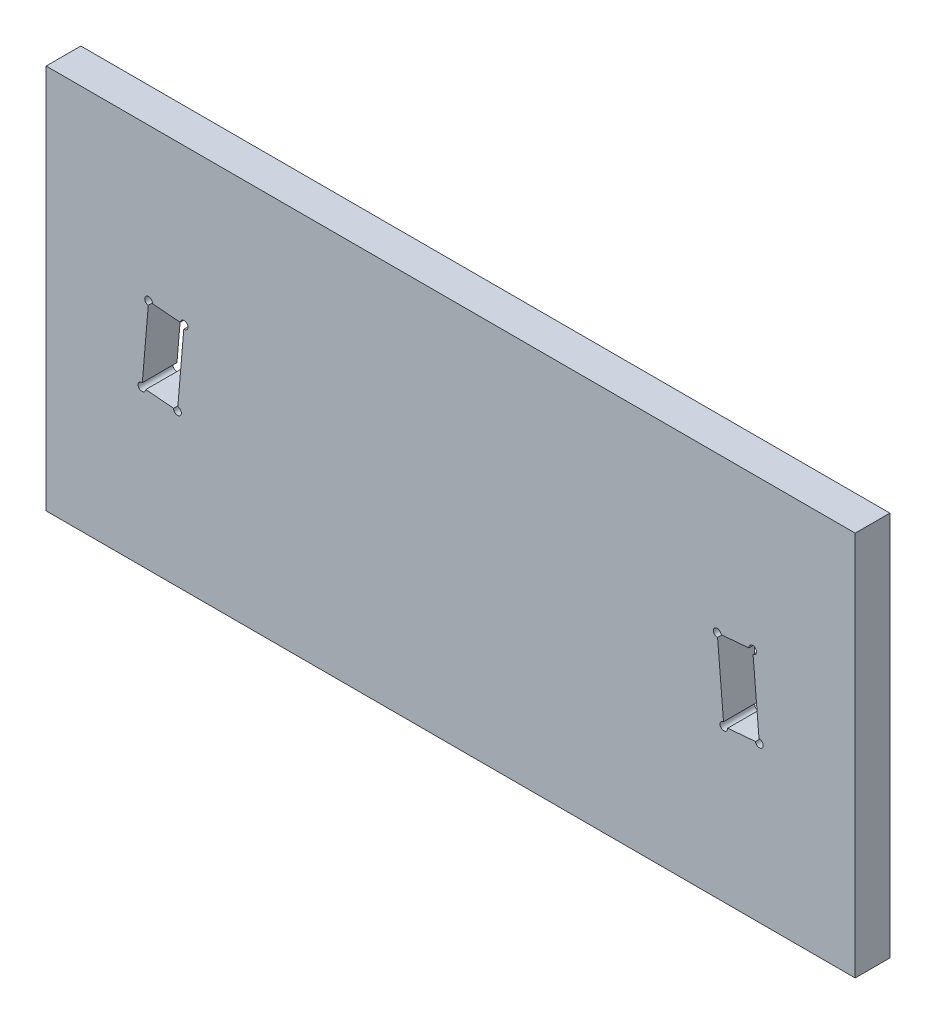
ISO-10303-21;
HEADER;
FILE_DESCRIPTION(('STEP AP214'),'2;1');
FILE_NAME('part.step','',(''),(''),'','','');
FILE_SCHEMA(('AUTOMOTIVE_DESIGN { 1 0 10303 214 1 1 1 1 }'));
ENDSEC;
DATA;
#1=APPLICATION_CONTEXT('core data for automotive mechanical design processes');
#2=APPLICATION_PROTOCOL_DEFINITION('international standard','automotive_design',2000,#1);
#3=PRODUCT_CONTEXT('',#1,'mechanical');
#4=PRODUCT('Part','Part','',(#3));
#5=PRODUCT_RELATED_PRODUCT_CATEGORY('part','',(#4));
#6=PRODUCT_DEFINITION_FORMATION('','',#4);
#7=PRODUCT_DEFINITION_CONTEXT('part definition',#1,'design');
#8=PRODUCT_DEFINITION('design','',#6,#7);
#9=PRODUCT_DEFINITION_SHAPE('','',#8);
#10=(LENGTH_UNIT() NAMED_UNIT(*) SI_UNIT(.MILLI.,.METRE.));
#11=(NAMED_UNIT(*) PLANE_ANGLE_UNIT() SI_UNIT($,.RADIAN.));
#12=(NAMED_UNIT(*) SI_UNIT($,.STERADIAN.) SOLID_ANGLE_UNIT());
#13=UNCERTAINTY_MEASURE_WITH_UNIT(LENGTH_MEASURE(1.E-05),#10,'distance_accuracy_value','');
#14=(GEOMETRIC_REPRESENTATION_CONTEXT(3) GLOBAL_UNCERTAINTY_ASSIGNED_CONTEXT((#13)) GLOBAL_UNIT_ASSIGNED_CONTEXT((#10,
#11,#12)) REPRESENTATION_CONTEXT('',''));
#15=CARTESIAN_POINT('',(0.,0.,0.));
#16=DIRECTION('',(0.,0.,1.));
#17=DIRECTION('',(1.,0.,0.));
#18=AXIS2_PLACEMENT_3D('',#15,#16,#17);
#19=CARTESIAN_POINT('',(0.,0.,18.));
#20=DIRECTION('',(0.,0.,-1.));
#21=DIRECTION('',(-1.,0.,0.));
#22=AXIS2_PLACEMENT_3D('',#19,#20,#21);
#23=PLANE('',#22);
#24=DIRECTION('',(0.0848221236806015,-0.996396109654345,0.));
#25=VECTOR('',#24,1.);
#26=CARTESIAN_POINT('',(123.236552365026,394.31803128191,18.));
#27=LINE('',#26,#25);
#28=CARTESIAN_POINT('',(119.970900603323,432.679281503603,18.));
#29=VERTEX_POINT('',#28);
#30=CARTESIAN_POINT('',(123.066908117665,396.310823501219,18.));
#31=VERTEX_POINT('',#30);
#32=EDGE_CURVE('E212',#29,#31,#27,.T.);
#33=ORIENTED_EDGE('',*,*,#32,.F.);
#34=CARTESIAN_POINT('',(119.801256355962,434.672073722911,18.));
#35=DIRECTION('',(0.,0.,1.));
#36=DIRECTION('',(1.,0.,0.));
#37=AXIS2_PLACEMENT_3D('',#34,#35,#36);
#38=CIRCLE('',#37,2.);
#39=CARTESIAN_POINT('',(121.79404857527,434.841717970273,18.));
#40=VERTEX_POINT('',#39);
#41=EDGE_CURVE('E175',#40,#29,#38,.T.);
#42=ORIENTED_EDGE('',*,*,#41,.F.);
#43=DIRECTION('',(-0.996396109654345,-0.0848221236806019,0.));
#44=VECTOR('',#43,1.);
#45=CARTESIAN_POINT('',(119.801256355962,434.672073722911,18.));
#46=LINE('',#45,#44);
#47=CARTESIAN_POINT('',(136.241792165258,436.071638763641,18.));
#48=VERTEX_POINT('',#47);
#49=EDGE_CURVE('E207',#48,#40,#46,.T.);
#50=ORIENTED_EDGE('',*,*,#49,.F.);
#51=CARTESIAN_POINT('',(138.234584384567,436.241283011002,18.));
#52=DIRECTION('',(0.,0.,1.));
#53=DIRECTION('',(1.,0.,0.));
#54=AXIS2_PLACEMENT_3D('',#51,#52,#53);
#55=CIRCLE('',#54,2.);
#56=CARTESIAN_POINT('',(138.404228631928,434.248490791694,18.));
#57=VERTEX_POINT('',#56);
#58=EDGE_CURVE('E509',#57,#48,#55,.T.);
#59=ORIENTED_EDGE('',*,*,#58,.F.);
#60=DIRECTION('',(-0.0848221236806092,0.996396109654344,0.));
#61=VECTOR('',#60,1.);
#62=CARTESIAN_POINT('',(138.234584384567,436.241283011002,18.));
#63=LINE('',#62,#61);
#64=CARTESIAN_POINT('',(141.50023614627,397.88003278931,18.));
#65=VERTEX_POINT('',#64);
#66=EDGE_CURVE('E501',#65,#57,#63,.T.);
#67=ORIENTED_EDGE('',*,*,#66,.F.);
#68=CARTESIAN_POINT('',(141.669880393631,395.887240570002,18.));
#69=DIRECTION('',(0.,0.,1.));
#70=DIRECTION('',(1.,0.,0.));
#71=AXIS2_PLACEMENT_3D('',#68,#69,#70);
#72=CIRCLE('',#71,2.);
#73=CARTESIAN_POINT('',(139.677088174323,395.71759632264,18.));
#74=VERTEX_POINT('',#73);
#75=EDGE_CURVE('E56',#74,#65,#72,.T.);
#76=ORIENTED_EDGE('',*,*,#75,.F.);
#77=DIRECTION('',(0.996396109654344,0.0848221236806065,0.));
#78=VECTOR('',#77,1.);
#79=CARTESIAN_POINT('',(141.669880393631,395.887240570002,18.));
#80=LINE('',#79,#78);
#81=CARTESIAN_POINT('',(125.229344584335,394.487675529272,18.));
#82=VERTEX_POINT('',#81);
#83=EDGE_CURVE('E499',#82,#74,#80,.T.);
#84=ORIENTED_EDGE('',*,*,#83,.F.);
#85=CARTESIAN_POINT('',(123.236552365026,394.31803128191,18.));
#86=DIRECTION('',(0.,0.,1.));
#87=DIRECTION('',(1.,0.,0.));
#88=AXIS2_PLACEMENT_3D('',#85,#86,#87);
#89=CIRCLE('',#88,2.);
#90=EDGE_CURVE('E48',#31,#82,#89,.T.);
#91=ORIENTED_EDGE('',*,*,#90,.F.);
#92=EDGE_LOOP('',(#33,#42,#50,#59,#67,#76,#84,#91));
#93=FACE_BOUND('',#92,.T.);
#94=DIRECTION('',(0.,1.,0.));
#95=VECTOR('',#94,1.);
#96=CARTESIAN_POINT('',(191.423400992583,515.279657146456,18.));
#97=LINE('',#96,#95);
#98=CARTESIAN_POINT('',(191.423400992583,315.279657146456,18.));
#99=VERTEX_POINT('',#98);
#100=CARTESIAN_POINT('',(191.423400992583,515.279657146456,18.));
#101=VERTEX_POINT('',#100);
#102=EDGE_CURVE('E213',#99,#101,#97,.T.);
#103=ORIENTED_EDGE('',*,*,#102,.T.);
#104=DIRECTION('',(-1.,0.,0.));
#105=VECTOR('',#104,1.);
#106=CARTESIAN_POINT('',(-228.576599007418,515.279657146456,18.));
#107=LINE('',#106,#105);
#108=CARTESIAN_POINT('',(-228.576599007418,515.279657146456,18.));
#109=VERTEX_POINT('',#108);
#110=EDGE_CURVE('E216',#101,#109,#107,.T.);
#111=ORIENTED_EDGE('',*,*,#110,.T.);
#112=DIRECTION('',(0.,-1.,0.));
#113=VECTOR('',#112,1.);
#114=CARTESIAN_POINT('',(-228.576599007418,515.279657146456,18.));
#115=LINE('',#114,#113);
#116=CARTESIAN_POINT('',(-228.576599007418,315.279657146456,18.));
#117=VERTEX_POINT('',#116);
#118=EDGE_CURVE('E219',#109,#117,#115,.T.);
#119=ORIENTED_EDGE('',*,*,#118,.T.);
#120=DIRECTION('',(1.,0.,0.));
#121=VECTOR('',#120,1.);
#122=CARTESIAN_POINT('',(191.423400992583,315.279657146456,18.));
#123=LINE('',#122,#121);
#124=EDGE_CURVE('E221',#117,#99,#123,.T.);
#125=ORIENTED_EDGE('',*,*,#124,.T.);
#126=EDGE_LOOP('',(#103,#111,#119,#125));
#127=FACE_BOUND('',#126,.T.);
#128=DIRECTION('',(-0.996396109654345,0.0848221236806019,0.));
#129=VECTOR('',#128,1.);
#130=CARTESIAN_POINT('',(-156.954454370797,434.672073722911,18.));
#131=LINE('',#130,#129);
#132=CARTESIAN_POINT('',(-158.947246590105,434.841717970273,18.));
#133=VERTEX_POINT('',#132);
#134=CARTESIAN_POINT('',(-173.394990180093,436.071638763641,18.));
#135=VERTEX_POINT('',#134);
#136=EDGE_CURVE('E204',#133,#135,#131,.T.);
#137=ORIENTED_EDGE('',*,*,#136,.F.);
#138=CARTESIAN_POINT('',(-156.954454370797,434.672073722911,18.));
#139=DIRECTION('',(0.,0.,1.));
#140=DIRECTION('',(1.,0.,0.));
#141=AXIS2_PLACEMENT_3D('',#138,#139,#140);
#142=CIRCLE('',#141,2.);
#143=CARTESIAN_POINT('',(-157.124098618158,432.679281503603,18.));
#144=VERTEX_POINT('',#143);
#145=EDGE_CURVE('E460',#144,#133,#142,.T.);
#146=ORIENTED_EDGE('',*,*,#145,.F.);
#147=DIRECTION('',(0.0848221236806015,0.996396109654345,0.));
#148=VECTOR('',#147,1.);
#149=CARTESIAN_POINT('',(-160.389750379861,394.31803128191,18.));
#150=LINE('',#149,#148);
#151=CARTESIAN_POINT('',(-160.2201061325,396.310823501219,18.));
#152=VERTEX_POINT('',#151);
#153=EDGE_CURVE('E481',#152,#144,#150,.T.);
#154=ORIENTED_EDGE('',*,*,#153,.F.);
#155=CARTESIAN_POINT('',(-160.389750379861,394.31803128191,18.));
#156=DIRECTION('',(0.,0.,1.));
#157=DIRECTION('',(1.,0.,0.));
#158=AXIS2_PLACEMENT_3D('',#155,#156,#157);
#159=CIRCLE('',#158,2.);
#160=CARTESIAN_POINT('',(-162.38254259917,394.487675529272,18.));
#161=VERTEX_POINT('',#160);
#162=EDGE_CURVE('E536',#161,#152,#159,.T.);
#163=ORIENTED_EDGE('',*,*,#162,.F.);
#164=DIRECTION('',(0.996396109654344,-0.0848221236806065,0.));
#165=VECTOR('',#164,1.);
#166=CARTESIAN_POINT('',(-178.823078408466,395.887240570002,18.));
#167=LINE('',#166,#165);
#168=CARTESIAN_POINT('',(-176.830286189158,395.71759632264,18.));
#169=VERTEX_POINT('',#168);
#170=EDGE_CURVE('E483',#169,#161,#167,.T.);
#171=ORIENTED_EDGE('',*,*,#170,.F.);
#172=CARTESIAN_POINT('',(-178.823078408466,395.887240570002,18.));
#173=DIRECTION('',(0.,0.,1.));
#174=DIRECTION('',(1.,0.,0.));
#175=AXIS2_PLACEMENT_3D('',#172,#173,#174);
#176=CIRCLE('',#175,2.);
#177=CARTESIAN_POINT('',(-178.653434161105,397.88003278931,18.));
#178=VERTEX_POINT('',#177);
#179=EDGE_CURVE('E555',#178,#169,#176,.T.);
#180=ORIENTED_EDGE('',*,*,#179,.F.);
#181=DIRECTION('',(-0.0848221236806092,-0.996396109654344,0.));
#182=VECTOR('',#181,1.);
#183=CARTESIAN_POINT('',(-175.387782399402,436.241283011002,18.));
#184=LINE('',#183,#182);
#185=CARTESIAN_POINT('',(-175.557426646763,434.248490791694,18.));
#186=VERTEX_POINT('',#185);
#187=EDGE_CURVE('E198',#186,#178,#184,.T.);
#188=ORIENTED_EDGE('',*,*,#187,.F.);
#189=CARTESIAN_POINT('',(-175.387782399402,436.241283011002,18.));
#190=DIRECTION('',(0.,0.,1.));
#191=DIRECTION('',(1.,0.,0.));
#192=AXIS2_PLACEMENT_3D('',#189,#190,#191);
#193=CIRCLE('',#192,2.);
#194=EDGE_CURVE('E480',#135,#186,#193,.T.);
#195=ORIENTED_EDGE('',*,*,#194,.F.);
#196=EDGE_LOOP('',(#137,#146,#154,#163,#171,#180,#188,#195));
#197=FACE_BOUND('',#196,.T.);
#198=ADVANCED_FACE('F33',(#93,#127,#197),#23,.F.);
#199=CARTESIAN_POINT('',(0.,0.,0.));
#200=DIRECTION('',(0.,0.,-1.));
#201=DIRECTION('',(-1.,0.,0.));
#202=AXIS2_PLACEMENT_3D('',#199,#200,#201);
#203=PLANE('',#202);
#204=CARTESIAN_POINT('',(119.801256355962,434.672073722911,0.));
#205=DIRECTION('',(0.,0.,-1.));
#206=DIRECTION('',(-1.,0.,0.));
#207=AXIS2_PLACEMENT_3D('',#204,#205,#206);
#208=CIRCLE('',#207,2.);
#209=CARTESIAN_POINT('',(121.79404857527,434.841717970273,0.));
#210=VERTEX_POINT('',#209);
#211=CARTESIAN_POINT('',(119.970900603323,432.679281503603,0.));
#212=VERTEX_POINT('',#211);
#213=EDGE_CURVE('E172',#210,#212,#208,.F.);
#214=ORIENTED_EDGE('',*,*,#213,.T.);
#215=DIRECTION('',(0.0848221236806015,-0.996396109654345,0.));
#216=VECTOR('',#215,1.);
#217=CARTESIAN_POINT('',(123.236552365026,394.31803128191,0.));
#218=LINE('',#217,#216);
#219=CARTESIAN_POINT('',(123.066908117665,396.310823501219,0.));
#220=VERTEX_POINT('',#219);
#221=EDGE_CURVE('E188',#212,#220,#218,.T.);
#222=ORIENTED_EDGE('',*,*,#221,.T.);
#223=CARTESIAN_POINT('',(123.236552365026,394.31803128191,0.));
#224=DIRECTION('',(0.,0.,-1.));
#225=DIRECTION('',(-1.,0.,0.));
#226=AXIS2_PLACEMENT_3D('',#223,#224,#225);
#227=CIRCLE('',#226,2.);
#228=CARTESIAN_POINT('',(125.229344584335,394.487675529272,0.));
#229=VERTEX_POINT('',#228);
#230=EDGE_CURVE('E516',#220,#229,#227,.F.);
#231=ORIENTED_EDGE('',*,*,#230,.T.);
#232=DIRECTION('',(0.996396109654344,0.0848221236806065,0.));
#233=VECTOR('',#232,1.);
#234=CARTESIAN_POINT('',(141.669880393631,395.887240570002,0.));
#235=LINE('',#234,#233);
#236=CARTESIAN_POINT('',(139.677088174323,395.71759632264,0.));
#237=VERTEX_POINT('',#236);
#238=EDGE_CURVE('E197',#229,#237,#235,.T.);
#239=ORIENTED_EDGE('',*,*,#238,.T.);
#240=CARTESIAN_POINT('',(141.669880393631,395.887240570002,0.));
#241=DIRECTION('',(0.,0.,-1.));
#242=DIRECTION('',(-1.,0.,0.));
#243=AXIS2_PLACEMENT_3D('',#240,#241,#242);
#244=CIRCLE('',#243,2.);
#245=CARTESIAN_POINT('',(141.50023614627,397.88003278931,0.));
#246=VERTEX_POINT('',#245);
#247=EDGE_CURVE('E519',#237,#246,#244,.F.);
#248=ORIENTED_EDGE('',*,*,#247,.T.);
#249=DIRECTION('',(-0.0848221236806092,0.996396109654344,0.));
#250=VECTOR('',#249,1.);
#251=CARTESIAN_POINT('',(138.234584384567,436.241283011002,0.));
#252=LINE('',#251,#250);
#253=CARTESIAN_POINT('',(138.404228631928,434.248490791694,0.));
#254=VERTEX_POINT('',#253);
#255=EDGE_CURVE('E201',#246,#254,#252,.T.);
#256=ORIENTED_EDGE('',*,*,#255,.T.);
#257=CARTESIAN_POINT('',(138.234584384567,436.241283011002,0.));
#258=DIRECTION('',(0.,0.,-1.));
#259=DIRECTION('',(-1.,0.,0.));
#260=AXIS2_PLACEMENT_3D('',#257,#258,#259);
#261=CIRCLE('',#260,2.);
#262=CARTESIAN_POINT('',(136.241792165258,436.071638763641,0.));
#263=VERTEX_POINT('',#262);
#264=EDGE_CURVE('E491',#254,#263,#261,.F.);
#265=ORIENTED_EDGE('',*,*,#264,.T.);
#266=DIRECTION('',(-0.996396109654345,-0.0848221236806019,0.));
#267=VECTOR('',#266,1.);
#268=CARTESIAN_POINT('',(119.801256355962,434.672073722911,0.));
#269=LINE('',#268,#267);
#270=EDGE_CURVE('E191',#263,#210,#269,.T.);
#271=ORIENTED_EDGE('',*,*,#270,.T.);
#272=EDGE_LOOP('',(#214,#222,#231,#239,#248,#256,#265,#271));
#273=FACE_BOUND('',#272,.T.);
#274=CARTESIAN_POINT('',(-156.954454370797,434.672073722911,0.));
#275=DIRECTION('',(0.,0.,-1.));
#276=DIRECTION('',(-1.,0.,0.));
#277=AXIS2_PLACEMENT_3D('',#274,#275,#276);
#278=CIRCLE('',#277,2.);
#279=CARTESIAN_POINT('',(-157.124098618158,432.679281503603,0.));
#280=VERTEX_POINT('',#279);
#281=CARTESIAN_POINT('',(-158.947246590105,434.841717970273,0.));
#282=VERTEX_POINT('',#281);
#283=EDGE_CURVE('E469',#280,#282,#278,.F.);
#284=ORIENTED_EDGE('',*,*,#283,.T.);
#285=DIRECTION('',(-0.996396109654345,0.0848221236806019,0.));
#286=VECTOR('',#285,1.);
#287=CARTESIAN_POINT('',(-156.954454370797,434.672073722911,0.));
#288=LINE('',#287,#286);
#289=CARTESIAN_POINT('',(-173.394990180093,436.071638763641,0.));
#290=VERTEX_POINT('',#289);
#291=EDGE_CURVE('E475',#282,#290,#288,.T.);
#292=ORIENTED_EDGE('',*,*,#291,.T.);
#293=CARTESIAN_POINT('',(-175.387782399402,436.241283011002,0.));
#294=DIRECTION('',(0.,0.,-1.));
#295=DIRECTION('',(-1.,0.,0.));
#296=AXIS2_PLACEMENT_3D('',#293,#294,#295);
#297=CIRCLE('',#296,2.);
#298=CARTESIAN_POINT('',(-175.557426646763,434.248490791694,0.));
#299=VERTEX_POINT('',#298);
#300=EDGE_CURVE('E533',#290,#299,#297,.F.);
#301=ORIENTED_EDGE('',*,*,#300,.T.);
#302=DIRECTION('',(-0.0848221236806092,-0.996396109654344,0.));
#303=VECTOR('',#302,1.);
#304=CARTESIAN_POINT('',(-175.387782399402,436.241283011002,0.));
#305=LINE('',#304,#303);
#306=CARTESIAN_POINT('',(-178.653434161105,397.88003278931,0.));
#307=VERTEX_POINT('',#306);
#308=EDGE_CURVE('E495',#299,#307,#305,.T.);
#309=ORIENTED_EDGE('',*,*,#308,.T.);
#310=CARTESIAN_POINT('',(-178.823078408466,395.887240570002,0.));
#311=DIRECTION('',(0.,0.,-1.));
#312=DIRECTION('',(-1.,0.,0.));
#313=AXIS2_PLACEMENT_3D('',#310,#311,#312);
#314=CIRCLE('',#313,2.);
#315=CARTESIAN_POINT('',(-176.830286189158,395.71759632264,0.));
#316=VERTEX_POINT('',#315);
#317=EDGE_CURVE('E544',#307,#316,#314,.F.);
#318=ORIENTED_EDGE('',*,*,#317,.T.);
#319=DIRECTION('',(0.996396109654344,-0.0848221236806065,0.));
#320=VECTOR('',#319,1.);
#321=CARTESIAN_POINT('',(-178.823078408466,395.887240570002,0.));
#322=LINE('',#321,#320);
#323=CARTESIAN_POINT('',(-162.38254259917,394.487675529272,0.));
#324=VERTEX_POINT('',#323);
#325=EDGE_CURVE('E487',#316,#324,#322,.T.);
#326=ORIENTED_EDGE('',*,*,#325,.T.);
#327=CARTESIAN_POINT('',(-160.389750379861,394.31803128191,0.));
#328=DIRECTION('',(0.,0.,-1.));
#329=DIRECTION('',(-1.,0.,0.));
#330=AXIS2_PLACEMENT_3D('',#327,#328,#329);
#331=CIRCLE('',#330,2.);
#332=CARTESIAN_POINT('',(-160.2201061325,396.310823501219,0.));
#333=VERTEX_POINT('',#332);
#334=EDGE_CURVE('E476',#324,#333,#331,.F.);
#335=ORIENTED_EDGE('',*,*,#334,.T.);
#336=DIRECTION('',(0.0848221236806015,0.996396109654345,0.));
#337=VECTOR('',#336,1.);
#338=CARTESIAN_POINT('',(-160.389750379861,394.31803128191,0.));
#339=LINE('',#338,#337);
#340=EDGE_CURVE('E490',#333,#280,#339,.T.);
#341=ORIENTED_EDGE('',*,*,#340,.T.);
#342=EDGE_LOOP('',(#284,#292,#301,#309,#318,#326,#335,#341));
#343=FACE_BOUND('',#342,.T.);
#344=DIRECTION('',(0.,1.,0.));
#345=VECTOR('',#344,1.);
#346=CARTESIAN_POINT('',(191.423400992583,515.279657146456,0.));
#347=LINE('',#346,#345);
#348=CARTESIAN_POINT('',(191.423400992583,315.279657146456,0.));
#349=VERTEX_POINT('',#348);
#350=CARTESIAN_POINT('',(191.423400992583,515.279657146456,0.));
#351=VERTEX_POINT('',#350);
#352=EDGE_CURVE('E224',#349,#351,#347,.T.);
#353=ORIENTED_EDGE('',*,*,#352,.F.);
#354=DIRECTION('',(1.,0.,0.));
#355=VECTOR('',#354,1.);
#356=CARTESIAN_POINT('',(191.423400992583,315.279657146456,0.));
#357=LINE('',#356,#355);
#358=CARTESIAN_POINT('',(-228.576599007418,315.279657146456,0.));
#359=VERTEX_POINT('',#358);
#360=EDGE_CURVE('E217',#359,#349,#357,.T.);
#361=ORIENTED_EDGE('',*,*,#360,.F.);
#362=DIRECTION('',(0.,-1.,0.));
#363=VECTOR('',#362,1.);
#364=CARTESIAN_POINT('',(-228.576599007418,515.279657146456,0.));
#365=LINE('',#364,#363);
#366=CARTESIAN_POINT('',(-228.576599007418,515.279657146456,0.));
#367=VERTEX_POINT('',#366);
#368=EDGE_CURVE('E229',#367,#359,#365,.T.);
#369=ORIENTED_EDGE('',*,*,#368,.F.);
#370=DIRECTION('',(-1.,0.,0.));
#371=VECTOR('',#370,1.);
#372=CARTESIAN_POINT('',(-228.576599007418,515.279657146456,0.));
#373=LINE('',#372,#371);
#374=EDGE_CURVE('E227',#351,#367,#373,.T.);
#375=ORIENTED_EDGE('',*,*,#374,.F.);
#376=EDGE_LOOP('',(#353,#361,#369,#375));
#377=FACE_BOUND('',#376,.T.);
#378=ADVANCED_FACE('F185',(#273,#343,#377),#203,.T.);
#379=CARTESIAN_POINT('',(191.423400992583,515.279657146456,18.));
#380=DIRECTION('',(-1.,0.,0.));
#381=DIRECTION('',(0.,-1.,0.));
#382=AXIS2_PLACEMENT_3D('',#379,#380,#381);
#383=PLANE('',#382);
#384=ORIENTED_EDGE('',*,*,#352,.T.);
#385=DIRECTION('',(0.,0.,-1.));
#386=VECTOR('',#385,1.);
#387=CARTESIAN_POINT('',(191.423400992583,515.279657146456,18.));
#388=LINE('',#387,#386);
#389=EDGE_CURVE('E11',#101,#351,#388,.T.);
#390=ORIENTED_EDGE('',*,*,#389,.F.);
#391=ORIENTED_EDGE('',*,*,#102,.F.);
#392=DIRECTION('',(0.,0.,-1.));
#393=VECTOR('',#392,1.);
#394=CARTESIAN_POINT('',(191.423400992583,315.279657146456,18.));
#395=LINE('',#394,#393);
#396=EDGE_CURVE('E223',#99,#349,#395,.T.);
#397=ORIENTED_EDGE('',*,*,#396,.T.);
#398=EDGE_LOOP('',(#384,#390,#391,#397));
#399=FACE_BOUND('',#398,.T.);
#400=ADVANCED_FACE('F35',(#399),#383,.F.);
#401=CARTESIAN_POINT('',(-228.576599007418,515.279657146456,18.));
#402=DIRECTION('',(0.,-1.,0.));
#403=DIRECTION('',(0.,0.,-1.));
#404=AXIS2_PLACEMENT_3D('',#401,#402,#403);
#405=PLANE('',#404);
#406=ORIENTED_EDGE('',*,*,#374,.T.);
#407=DIRECTION('',(0.,0.,-1.));
#408=VECTOR('',#407,1.);
#409=CARTESIAN_POINT('',(-228.576599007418,515.279657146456,18.));
#410=LINE('',#409,#408);
#411=EDGE_CURVE('E41',#109,#367,#410,.T.);
#412=ORIENTED_EDGE('',*,*,#411,.F.);
#413=ORIENTED_EDGE('',*,*,#110,.F.);
#414=ORIENTED_EDGE('',*,*,#389,.T.);
#415=EDGE_LOOP('',(#406,#412,#413,#414));
#416=FACE_BOUND('',#415,.T.);
#417=ADVANCED_FACE('F256',(#416),#405,.F.);
#418=CARTESIAN_POINT('',(-228.576599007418,515.279657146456,18.));
#419=DIRECTION('',(1.,0.,0.));
#420=DIRECTION('',(0.,1.,0.));
#421=AXIS2_PLACEMENT_3D('',#418,#419,#420);
#422=PLANE('',#421);
#423=ORIENTED_EDGE('',*,*,#368,.T.);
#424=DIRECTION('',(0.,0.,-1.));
#425=VECTOR('',#424,1.);
#426=CARTESIAN_POINT('',(-228.576599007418,315.279657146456,18.));
#427=LINE('',#426,#425);
#428=EDGE_CURVE('E234',#117,#359,#427,.T.);
#429=ORIENTED_EDGE('',*,*,#428,.F.);
#430=ORIENTED_EDGE('',*,*,#118,.F.);
#431=ORIENTED_EDGE('',*,*,#411,.T.);
#432=EDGE_LOOP('',(#423,#429,#430,#431));
#433=FACE_BOUND('',#432,.T.);
#434=ADVANCED_FACE('F241',(#433),#422,.F.);
#435=CARTESIAN_POINT('',(191.423400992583,315.279657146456,18.));
#436=DIRECTION('',(0.,1.,0.));
#437=DIRECTION('',(-1.,0.,0.));
#438=AXIS2_PLACEMENT_3D('',#435,#436,#437);
#439=PLANE('',#438);
#440=ORIENTED_EDGE('',*,*,#360,.T.);
#441=ORIENTED_EDGE('',*,*,#396,.F.);
#442=ORIENTED_EDGE('',*,*,#124,.F.);
#443=ORIENTED_EDGE('',*,*,#428,.T.);
#444=EDGE_LOOP('',(#440,#441,#442,#443));
#445=FACE_BOUND('',#444,.T.);
#446=ADVANCED_FACE('F249',(#445),#439,.F.);
#447=CARTESIAN_POINT('',(123.236552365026,394.31803128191,18.));
#448=DIRECTION('',(0.996396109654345,0.0848221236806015,0.));
#449=DIRECTION('',(-0.0848221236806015,0.996396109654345,0.));
#450=AXIS2_PLACEMENT_3D('',#447,#448,#449);
#451=PLANE('',#450);
#452=DIRECTION('',(0.,0.,1.));
#453=VECTOR('',#452,1.);
#454=CARTESIAN_POINT('',(119.970900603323,432.679281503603,-0.001000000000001));
#455=LINE('',#454,#453);
#456=EDGE_CURVE('E169',#212,#29,#455,.T.);
#457=ORIENTED_EDGE('',*,*,#456,.T.);
#458=ORIENTED_EDGE('',*,*,#32,.T.);
#459=DIRECTION('',(0.,0.,1.));
#460=VECTOR('',#459,1.);
#461=CARTESIAN_POINT('',(123.066908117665,396.310823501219,-0.001000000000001));
#462=LINE('',#461,#460);
#463=EDGE_CURVE('E196',#31,#220,#462,.F.);
#464=ORIENTED_EDGE('',*,*,#463,.T.);
#465=ORIENTED_EDGE('',*,*,#221,.F.);
#466=EDGE_LOOP('',(#457,#458,#464,#465));
#467=FACE_BOUND('',#466,.T.);
#468=ADVANCED_FACE('F195',(#467),#451,.T.);
#469=CARTESIAN_POINT('',(141.669880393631,395.887240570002,18.));
#470=DIRECTION('',(-0.0848221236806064,0.996396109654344,0.));
#471=DIRECTION('',(-0.996396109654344,-0.0848221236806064,0.));
#472=AXIS2_PLACEMENT_3D('',#469,#470,#471);
#473=PLANE('',#472);
#474=DIRECTION('',(0.,0.,1.));
#475=VECTOR('',#474,1.);
#476=CARTESIAN_POINT('',(139.677088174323,395.71759632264,-0.001000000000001));
#477=LINE('',#476,#475);
#478=EDGE_CURVE('E515',#74,#237,#477,.F.);
#479=ORIENTED_EDGE('',*,*,#478,.T.);
#480=ORIENTED_EDGE('',*,*,#238,.F.);
#481=DIRECTION('',(0.,0.,1.));
#482=VECTOR('',#481,1.);
#483=CARTESIAN_POINT('',(125.229344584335,394.487675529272,-0.001000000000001));
#484=LINE('',#483,#482);
#485=EDGE_CURVE('E522',#229,#82,#484,.T.);
#486=ORIENTED_EDGE('',*,*,#485,.T.);
#487=ORIENTED_EDGE('',*,*,#83,.T.);
#488=EDGE_LOOP('',(#479,#480,#486,#487));
#489=FACE_BOUND('',#488,.T.);
#490=ADVANCED_FACE('F278',(#489),#473,.T.);
#491=CARTESIAN_POINT('',(138.234584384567,436.241283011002,18.));
#492=DIRECTION('',(-0.996396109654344,-0.0848221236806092,0.));
#493=DIRECTION('',(0.0848221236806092,-0.996396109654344,0.));
#494=AXIS2_PLACEMENT_3D('',#491,#492,#493);
#495=PLANE('',#494);
#496=DIRECTION('',(0.,0.,1.));
#497=VECTOR('',#496,1.);
#498=CARTESIAN_POINT('',(141.50023614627,397.88003278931,-0.001000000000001));
#499=LINE('',#498,#497);
#500=EDGE_CURVE('E513',#246,#65,#499,.T.);
#501=ORIENTED_EDGE('',*,*,#500,.T.);
#502=ORIENTED_EDGE('',*,*,#66,.T.);
#503=DIRECTION('',(0.,0.,1.));
#504=VECTOR('',#503,1.);
#505=CARTESIAN_POINT('',(138.404228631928,434.248490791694,-0.001000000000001));
#506=LINE('',#505,#504);
#507=EDGE_CURVE('E560',#57,#254,#506,.F.);
#508=ORIENTED_EDGE('',*,*,#507,.T.);
#509=ORIENTED_EDGE('',*,*,#255,.F.);
#510=EDGE_LOOP('',(#501,#502,#508,#509));
#511=FACE_BOUND('',#510,.T.);
#512=ADVANCED_FACE('F281',(#511),#495,.T.);
#513=CARTESIAN_POINT('',(119.801256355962,434.672073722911,18.));
#514=DIRECTION('',(0.0848221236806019,-0.996396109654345,0.));
#515=DIRECTION('',(0.996396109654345,0.0848221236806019,0.));
#516=AXIS2_PLACEMENT_3D('',#513,#514,#515);
#517=PLANE('',#516);
#518=DIRECTION('',(0.,0.,1.));
#519=VECTOR('',#518,1.);
#520=CARTESIAN_POINT('',(121.79404857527,434.841717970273,-0.001000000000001));
#521=LINE('',#520,#519);
#522=EDGE_CURVE('E180',#40,#210,#521,.F.);
#523=ORIENTED_EDGE('',*,*,#522,.T.);
#524=ORIENTED_EDGE('',*,*,#270,.F.);
#525=DIRECTION('',(0.,0.,1.));
#526=VECTOR('',#525,1.);
#527=CARTESIAN_POINT('',(136.241792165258,436.071638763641,-0.001000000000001));
#528=LINE('',#527,#526);
#529=EDGE_CURVE('E192',#263,#48,#528,.T.);
#530=ORIENTED_EDGE('',*,*,#529,.T.);
#531=ORIENTED_EDGE('',*,*,#49,.T.);
#532=EDGE_LOOP('',(#523,#524,#530,#531));
#533=FACE_BOUND('',#532,.T.);
#534=ADVANCED_FACE('F286',(#533),#517,.T.);
#535=CARTESIAN_POINT('',(-178.823078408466,395.887240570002,18.));
#536=DIRECTION('',(0.0848221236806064,0.996396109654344,0.));
#537=DIRECTION('',(-0.996396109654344,0.0848221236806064,0.));
#538=AXIS2_PLACEMENT_3D('',#535,#536,#537);
#539=PLANE('',#538);
#540=DIRECTION('',(0.,0.,1.));
#541=VECTOR('',#540,1.);
#542=CARTESIAN_POINT('',(-162.38254259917,394.487675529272,-0.001000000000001));
#543=LINE('',#542,#541);
#544=EDGE_CURVE('E532',#161,#324,#543,.F.);
#545=ORIENTED_EDGE('',*,*,#544,.T.);
#546=ORIENTED_EDGE('',*,*,#325,.F.);
#547=DIRECTION('',(0.,0.,1.));
#548=VECTOR('',#547,1.);
#549=CARTESIAN_POINT('',(-176.830286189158,395.71759632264,-0.001000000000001));
#550=LINE('',#549,#548);
#551=EDGE_CURVE('E552',#316,#169,#550,.T.);
#552=ORIENTED_EDGE('',*,*,#551,.T.);
#553=ORIENTED_EDGE('',*,*,#170,.T.);
#554=EDGE_LOOP('',(#545,#546,#552,#553));
#555=FACE_BOUND('',#554,.T.);
#556=ADVANCED_FACE('F293',(#555),#539,.T.);
#557=CARTESIAN_POINT('',(-160.389750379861,394.31803128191,18.));
#558=DIRECTION('',(-0.996396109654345,0.0848221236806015,0.));
#559=DIRECTION('',(-0.0848221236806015,-0.996396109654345,0.));
#560=AXIS2_PLACEMENT_3D('',#557,#558,#559);
#561=PLANE('',#560);
#562=DIRECTION('',(0.,0.,1.));
#563=VECTOR('',#562,1.);
#564=CARTESIAN_POINT('',(-157.124098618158,432.679281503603,-0.001000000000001));
#565=LINE('',#564,#563);
#566=EDGE_CURVE('E465',#144,#280,#565,.F.);
#567=ORIENTED_EDGE('',*,*,#566,.T.);
#568=ORIENTED_EDGE('',*,*,#340,.F.);
#569=DIRECTION('',(0.,0.,1.));
#570=VECTOR('',#569,1.);
#571=CARTESIAN_POINT('',(-160.2201061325,396.310823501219,-0.001000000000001));
#572=LINE('',#571,#570);
#573=EDGE_CURVE('E529',#333,#152,#572,.T.);
#574=ORIENTED_EDGE('',*,*,#573,.T.);
#575=ORIENTED_EDGE('',*,*,#153,.T.);
#576=EDGE_LOOP('',(#567,#568,#574,#575));
#577=FACE_BOUND('',#576,.T.);
#578=ADVANCED_FACE('F297',(#577),#561,.T.);
#579=CARTESIAN_POINT('',(-156.954454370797,434.672073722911,18.));
#580=DIRECTION('',(-0.0848221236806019,-0.996396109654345,0.));
#581=DIRECTION('',(0.996396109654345,-0.0848221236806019,0.));
#582=AXIS2_PLACEMENT_3D('',#579,#580,#581);
#583=PLANE('',#582);
#584=DIRECTION('',(0.,0.,1.));
#585=VECTOR('',#584,1.);
#586=CARTESIAN_POINT('',(-158.947246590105,434.841717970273,-0.001000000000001));
#587=LINE('',#586,#585);
#588=EDGE_CURVE('E462',#282,#133,#587,.T.);
#589=ORIENTED_EDGE('',*,*,#588,.T.);
#590=ORIENTED_EDGE('',*,*,#136,.T.);
#591=DIRECTION('',(0.,0.,1.));
#592=VECTOR('',#591,1.);
#593=CARTESIAN_POINT('',(-173.394990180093,436.071638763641,-0.001000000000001));
#594=LINE('',#593,#592);
#595=EDGE_CURVE('E543',#135,#290,#594,.F.);
#596=ORIENTED_EDGE('',*,*,#595,.T.);
#597=ORIENTED_EDGE('',*,*,#291,.F.);
#598=EDGE_LOOP('',(#589,#590,#596,#597));
#599=FACE_BOUND('',#598,.T.);
#600=ADVANCED_FACE('F301',(#599),#583,.T.);
#601=CARTESIAN_POINT('',(-175.387782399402,436.241283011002,18.));
#602=DIRECTION('',(0.996396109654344,-0.0848221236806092,0.));
#603=DIRECTION('',(0.0848221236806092,0.996396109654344,0.));
#604=AXIS2_PLACEMENT_3D('',#601,#602,#603);
#605=PLANE('',#604);
#606=DIRECTION('',(0.,0.,1.));
#607=VECTOR('',#606,1.);
#608=CARTESIAN_POINT('',(-175.557426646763,434.248490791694,-0.001000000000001));
#609=LINE('',#608,#607);
#610=EDGE_CURVE('E540',#299,#186,#609,.T.);
#611=ORIENTED_EDGE('',*,*,#610,.T.);
#612=ORIENTED_EDGE('',*,*,#187,.T.);
#613=DIRECTION('',(0.,0.,1.));
#614=VECTOR('',#613,1.);
#615=CARTESIAN_POINT('',(-178.653434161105,397.88003278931,-0.001000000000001));
#616=LINE('',#615,#614);
#617=EDGE_CURVE('E549',#178,#307,#616,.F.);
#618=ORIENTED_EDGE('',*,*,#617,.T.);
#619=ORIENTED_EDGE('',*,*,#308,.F.);
#620=EDGE_LOOP('',(#611,#612,#618,#619));
#621=FACE_BOUND('',#620,.T.);
#622=ADVANCED_FACE('F305',(#621),#605,.T.);
#623=CARTESIAN_POINT('',(138.234584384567,436.241283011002,-0.001000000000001));
#624=DIRECTION('',(0.,0.,1.));
#625=DIRECTION('',(1.,0.,0.));
#626=AXIS2_PLACEMENT_3D('',#623,#624,#625);
#627=CYLINDRICAL_SURFACE('',#626,2.);
#628=ORIENTED_EDGE('',*,*,#58,.T.);
#629=ORIENTED_EDGE('',*,*,#529,.F.);
#630=ORIENTED_EDGE('',*,*,#264,.F.);
#631=ORIENTED_EDGE('',*,*,#507,.F.);
#632=EDGE_LOOP('',(#628,#629,#630,#631));
#633=FACE_BOUND('',#632,.T.);
#634=ADVANCED_FACE('F309',(#633),#627,.F.);
#635=CARTESIAN_POINT('',(-178.823078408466,395.887240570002,-0.001000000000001));
#636=DIRECTION('',(0.,0.,1.));
#637=DIRECTION('',(1.,0.,0.));
#638=AXIS2_PLACEMENT_3D('',#635,#636,#637);
#639=CYLINDRICAL_SURFACE('',#638,2.);
#640=ORIENTED_EDGE('',*,*,#317,.F.);
#641=ORIENTED_EDGE('',*,*,#617,.F.);
#642=ORIENTED_EDGE('',*,*,#179,.T.);
#643=ORIENTED_EDGE('',*,*,#551,.F.);
#644=EDGE_LOOP('',(#640,#641,#642,#643));
#645=FACE_BOUND('',#644,.T.);
#646=ADVANCED_FACE('F313',(#645),#639,.F.);
#647=CARTESIAN_POINT('',(-175.387782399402,436.241283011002,-0.001000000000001));
#648=DIRECTION('',(0.,0.,1.));
#649=DIRECTION('',(1.,0.,0.));
#650=AXIS2_PLACEMENT_3D('',#647,#648,#649);
#651=CYLINDRICAL_SURFACE('',#650,2.);
#652=ORIENTED_EDGE('',*,*,#194,.T.);
#653=ORIENTED_EDGE('',*,*,#610,.F.);
#654=ORIENTED_EDGE('',*,*,#300,.F.);
#655=ORIENTED_EDGE('',*,*,#595,.F.);
#656=EDGE_LOOP('',(#652,#653,#654,#655));
#657=FACE_BOUND('',#656,.T.);
#658=ADVANCED_FACE('F317',(#657),#651,.F.);
#659=CARTESIAN_POINT('',(-156.954454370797,434.672073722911,-0.001000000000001));
#660=DIRECTION('',(0.,0.,1.));
#661=DIRECTION('',(1.,0.,0.));
#662=AXIS2_PLACEMENT_3D('',#659,#660,#661);
#663=CYLINDRICAL_SURFACE('',#662,2.);
#664=ORIENTED_EDGE('',*,*,#145,.T.);
#665=ORIENTED_EDGE('',*,*,#588,.F.);
#666=ORIENTED_EDGE('',*,*,#283,.F.);
#667=ORIENTED_EDGE('',*,*,#566,.F.);
#668=EDGE_LOOP('',(#664,#665,#666,#667));
#669=FACE_BOUND('',#668,.T.);
#670=ADVANCED_FACE('F321',(#669),#663,.F.);
#671=CARTESIAN_POINT('',(-160.389750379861,394.31803128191,-0.001000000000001));
#672=DIRECTION('',(0.,0.,1.));
#673=DIRECTION('',(1.,0.,0.));
#674=AXIS2_PLACEMENT_3D('',#671,#672,#673);
#675=CYLINDRICAL_SURFACE('',#674,2.);
#676=ORIENTED_EDGE('',*,*,#162,.T.);
#677=ORIENTED_EDGE('',*,*,#573,.F.);
#678=ORIENTED_EDGE('',*,*,#334,.F.);
#679=ORIENTED_EDGE('',*,*,#544,.F.);
#680=EDGE_LOOP('',(#676,#677,#678,#679));
#681=FACE_BOUND('',#680,.T.);
#682=ADVANCED_FACE('F323',(#681),#675,.F.);
#683=CARTESIAN_POINT('',(119.801256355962,434.672073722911,-0.001000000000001));
#684=DIRECTION('',(0.,0.,1.));
#685=DIRECTION('',(1.,0.,0.));
#686=AXIS2_PLACEMENT_3D('',#683,#684,#685);
#687=CYLINDRICAL_SURFACE('',#686,2.);
#688=ORIENTED_EDGE('',*,*,#213,.F.);
#689=ORIENTED_EDGE('',*,*,#522,.F.);
#690=ORIENTED_EDGE('',*,*,#41,.T.);
#691=ORIENTED_EDGE('',*,*,#456,.F.);
#692=EDGE_LOOP('',(#688,#689,#690,#691));
#693=FACE_BOUND('',#692,.T.);
#694=ADVANCED_FACE('F171',(#693),#687,.F.);
#695=CARTESIAN_POINT('',(141.669880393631,395.887240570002,-0.001000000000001));
#696=DIRECTION('',(0.,0.,1.));
#697=DIRECTION('',(1.,0.,0.));
#698=AXIS2_PLACEMENT_3D('',#695,#696,#697);
#699=CYLINDRICAL_SURFACE('',#698,2.);
#700=ORIENTED_EDGE('',*,*,#75,.T.);
#701=ORIENTED_EDGE('',*,*,#500,.F.);
#702=ORIENTED_EDGE('',*,*,#247,.F.);
#703=ORIENTED_EDGE('',*,*,#478,.F.);
#704=EDGE_LOOP('',(#700,#701,#702,#703));
#705=FACE_BOUND('',#704,.T.);
#706=ADVANCED_FACE('F333',(#705),#699,.F.);
#707=CARTESIAN_POINT('',(123.236552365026,394.31803128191,-0.001000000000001));
#708=DIRECTION('',(0.,0.,1.));
#709=DIRECTION('',(1.,0.,0.));
#710=AXIS2_PLACEMENT_3D('',#707,#708,#709);
#711=CYLINDRICAL_SURFACE('',#710,2.);
#712=ORIENTED_EDGE('',*,*,#90,.T.);
#713=ORIENTED_EDGE('',*,*,#485,.F.);
#714=ORIENTED_EDGE('',*,*,#230,.F.);
#715=ORIENTED_EDGE('',*,*,#463,.F.);
#716=EDGE_LOOP('',(#712,#713,#714,#715));
#717=FACE_BOUND('',#716,.T.);
#718=ADVANCED_FACE('F330',(#717),#711,.F.);
#719=CLOSED_SHELL('',(#198,#378,#400,#417,#434,#446,#468,#490,#512,#534,#556,#578,#600,#622,
#634,#646,#658,#670,#682,#694,#706,#718));
#720=MANIFOLD_SOLID_BREP('B2',#719);
#721=ADVANCED_BREP_SHAPE_REPRESENTATION('',(#18,#720),#14);
#722=SHAPE_DEFINITION_REPRESENTATION(#9,#721);
ENDSEC;
END-ISO-10303-21;
